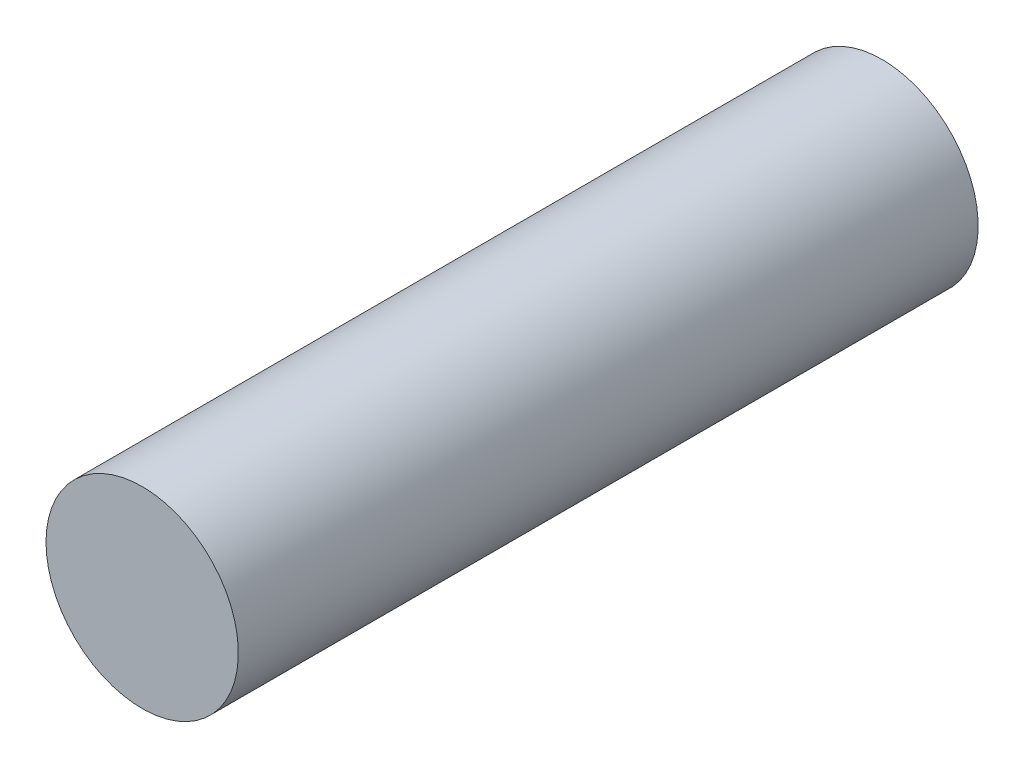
ISO-10303-21;
HEADER;
FILE_DESCRIPTION(('STEP AP214'),'2;1');
FILE_NAME('part.step','',(''),(''),'','','');
FILE_SCHEMA(('AUTOMOTIVE_DESIGN { 1 0 10303 214 1 1 1 1 }'));
ENDSEC;
DATA;
#1=APPLICATION_CONTEXT('core data for automotive mechanical design processes');
#2=APPLICATION_PROTOCOL_DEFINITION('international standard','automotive_design',2000,#1);
#3=PRODUCT_CONTEXT('',#1,'mechanical');
#4=PRODUCT('Part','Part','',(#3));
#5=PRODUCT_RELATED_PRODUCT_CATEGORY('part','',(#4));
#6=PRODUCT_DEFINITION_FORMATION('','',#4);
#7=PRODUCT_DEFINITION_CONTEXT('part definition',#1,'design');
#8=PRODUCT_DEFINITION('design','',#6,#7);
#9=PRODUCT_DEFINITION_SHAPE('','',#8);
#10=(LENGTH_UNIT() NAMED_UNIT(*) SI_UNIT(.MILLI.,.METRE.));
#11=(NAMED_UNIT(*) PLANE_ANGLE_UNIT() SI_UNIT($,.RADIAN.));
#12=(NAMED_UNIT(*) SI_UNIT($,.STERADIAN.) SOLID_ANGLE_UNIT());
#13=UNCERTAINTY_MEASURE_WITH_UNIT(LENGTH_MEASURE(1.E-05),#10,'distance_accuracy_value','');
#14=(GEOMETRIC_REPRESENTATION_CONTEXT(3) GLOBAL_UNCERTAINTY_ASSIGNED_CONTEXT((#13)) GLOBAL_UNIT_ASSIGNED_CONTEXT((#10,
#11,#12)) REPRESENTATION_CONTEXT('',''));
#15=CARTESIAN_POINT('',(0.,0.,0.));
#16=DIRECTION('',(0.,0.,1.));
#17=DIRECTION('',(1.,0.,0.));
#18=AXIS2_PLACEMENT_3D('',#15,#16,#17);
#19=CARTESIAN_POINT('',(0.,0.,15.24));
#20=DIRECTION('',(0.,0.,-1.));
#21=DIRECTION('',(-1.,0.,0.));
#22=AXIS2_PLACEMENT_3D('',#19,#20,#21);
#23=CYLINDRICAL_SURFACE('',#22,1.9812);
#24=CARTESIAN_POINT('',(0.,0.,15.24));
#25=DIRECTION('',(0.,0.,1.));
#26=DIRECTION('',(1.,0.,0.));
#27=AXIS2_PLACEMENT_3D('',#24,#25,#26);
#28=CIRCLE('',#27,1.9812);
#29=CARTESIAN_POINT('',(-1.9812,0.,15.24));
#30=VERTEX_POINT('',#29);
#31=EDGE_CURVE('E10',#30,#30,#28,.T.);
#32=CARTESIAN_POINT('',(0.,0.,0.));
#33=DIRECTION('',(0.,0.,1.));
#34=DIRECTION('',(1.,0.,0.));
#35=AXIS2_PLACEMENT_3D('',#32,#33,#34);
#36=CIRCLE('',#35,1.9812);
#37=CARTESIAN_POINT('',(-1.9812,0.,0.));
#38=VERTEX_POINT('',#37);
#39=EDGE_CURVE('E39',#38,#38,#36,.T.);
#40=CARTESIAN_POINT('',(-1.9812,0.,15.24));
#41=CARTESIAN_POINT('',(-1.9812,0.,15.08125));
#42=CARTESIAN_POINT('',(-1.9812,0.,14.9225));
#43=CARTESIAN_POINT('',(-1.9812,0.,14.605));
#44=CARTESIAN_POINT('',(-1.9812,0.,14.44625));
#45=CARTESIAN_POINT('',(-1.9812,0.,14.12875));
#46=CARTESIAN_POINT('',(-1.9812,0.,13.97));
#47=CARTESIAN_POINT('',(-1.9812,0.,13.6525));
#48=CARTESIAN_POINT('',(-1.9812,0.,13.49375));
#49=CARTESIAN_POINT('',(-1.9812,0.,13.17625));
#50=CARTESIAN_POINT('',(-1.9812,0.,13.0175));
#51=CARTESIAN_POINT('',(-1.9812,0.,12.7));
#52=CARTESIAN_POINT('',(-1.9812,0.,12.54125));
#53=CARTESIAN_POINT('',(-1.9812,0.,12.22375));
#54=CARTESIAN_POINT('',(-1.9812,0.,12.065));
#55=CARTESIAN_POINT('',(-1.9812,0.,11.7475));
#56=CARTESIAN_POINT('',(-1.9812,0.,11.58875));
#57=CARTESIAN_POINT('',(-1.9812,0.,11.27125));
#58=CARTESIAN_POINT('',(-1.9812,0.,11.1125));
#59=CARTESIAN_POINT('',(-1.9812,0.,10.795));
#60=CARTESIAN_POINT('',(-1.9812,0.,10.63625));
#61=CARTESIAN_POINT('',(-1.9812,0.,10.31875));
#62=CARTESIAN_POINT('',(-1.9812,0.,10.16));
#63=CARTESIAN_POINT('',(-1.9812,0.,9.8425));
#64=CARTESIAN_POINT('',(-1.9812,0.,9.68375));
#65=CARTESIAN_POINT('',(-1.9812,0.,9.36625));
#66=CARTESIAN_POINT('',(-1.9812,0.,9.2075));
#67=CARTESIAN_POINT('',(-1.9812,0.,8.89));
#68=CARTESIAN_POINT('',(-1.9812,0.,8.73125));
#69=CARTESIAN_POINT('',(-1.9812,0.,8.41375));
#70=CARTESIAN_POINT('',(-1.9812,0.,8.255));
#71=CARTESIAN_POINT('',(-1.9812,0.,7.9375));
#72=CARTESIAN_POINT('',(-1.9812,0.,7.77875));
#73=CARTESIAN_POINT('',(-1.9812,0.,7.46125));
#74=CARTESIAN_POINT('',(-1.9812,0.,7.3025));
#75=CARTESIAN_POINT('',(-1.9812,0.,6.985));
#76=CARTESIAN_POINT('',(-1.9812,0.,6.82625));
#77=CARTESIAN_POINT('',(-1.9812,0.,6.50875));
#78=CARTESIAN_POINT('',(-1.9812,0.,6.35));
#79=CARTESIAN_POINT('',(-1.9812,0.,6.0325));
#80=CARTESIAN_POINT('',(-1.9812,0.,5.87375));
#81=CARTESIAN_POINT('',(-1.9812,0.,5.55625));
#82=CARTESIAN_POINT('',(-1.9812,0.,5.3975));
#83=CARTESIAN_POINT('',(-1.9812,0.,5.08));
#84=CARTESIAN_POINT('',(-1.9812,0.,4.92125));
#85=CARTESIAN_POINT('',(-1.9812,0.,4.60375));
#86=CARTESIAN_POINT('',(-1.9812,0.,4.445));
#87=CARTESIAN_POINT('',(-1.9812,0.,4.1275));
#88=CARTESIAN_POINT('',(-1.9812,0.,3.96875));
#89=CARTESIAN_POINT('',(-1.9812,0.,3.65125));
#90=CARTESIAN_POINT('',(-1.9812,0.,3.4925));
#91=CARTESIAN_POINT('',(-1.9812,0.,3.175));
#92=CARTESIAN_POINT('',(-1.9812,0.,3.01625));
#93=CARTESIAN_POINT('',(-1.9812,0.,2.69875));
#94=CARTESIAN_POINT('',(-1.9812,0.,2.54));
#95=CARTESIAN_POINT('',(-1.9812,0.,2.2225));
#96=CARTESIAN_POINT('',(-1.9812,0.,2.06375));
#97=CARTESIAN_POINT('',(-1.9812,0.,1.74625));
#98=CARTESIAN_POINT('',(-1.9812,0.,1.5875));
#99=CARTESIAN_POINT('',(-1.9812,0.,1.27));
#100=CARTESIAN_POINT('',(-1.9812,0.,1.11125));
#101=CARTESIAN_POINT('',(-1.9812,0.,0.79375));
#102=CARTESIAN_POINT('',(-1.9812,0.,0.634999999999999));
#103=CARTESIAN_POINT('',(-1.9812,0.,0.3175));
#104=CARTESIAN_POINT('',(-1.9812,0.,0.15875));
#105=CARTESIAN_POINT('',(-1.9812,0.,0.));
#106=B_SPLINE_CURVE_WITH_KNOTS('',3,(#40,#41,#42,#43,#44,#45,#46,#47,#48,#49,#50,#51,#52,#53,
#54,#55,#56,#57,#58,#59,#60,#61,#62,#63,#64,#65,#66,#67,#68,#69,#70,#71,#72,#73,#74,#75,#76,#77,
#78,#79,#80,#81,#82,#83,#84,#85,#86,#87,#88,#89,#90,#91,#92,#93,#94,#95,#96,#97,#98,#99,#100,
#101,#102,#103,#104,#105),.UNSPECIFIED.,.F.,.F.,(4,2,2,2,2,2,2,2,2,2,2,2,2,2,2,2,2,2,2,2,2,2,2,
2,2,2,2,2,2,2,2,2,4),(0.,0.476249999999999,0.952499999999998,1.42875,1.905,2.38125,2.8575,
3.33375,3.81,4.28625,4.7625,5.23875,5.715,6.19125,6.6675,7.14375,7.62,8.09625,8.5725,9.04875,
9.525,10.00125,10.4775,10.95375,11.43,11.90625,12.3825,12.85875,13.335,13.81125,14.2875,
14.76375,15.24),.UNSPECIFIED.);
#107=EDGE_CURVE('BSEAM33',#30,#38,#106,.T.);
#108=ORIENTED_EDGE('',*,*,#31,.F.);
#109=ORIENTED_EDGE('',*,*,#39,.T.);
#110=ORIENTED_EDGE('',*,*,#107,.T.);
#111=ORIENTED_EDGE('',*,*,#107,.F.);
#112=EDGE_LOOP('',(#108,#110,#109,#111));
#113=FACE_BOUND('',#112,.T.);
#114=ADVANCED_FACE('F33',(#113),#23,.T.);
#115=CARTESIAN_POINT('',(0.,0.,15.24));
#116=DIRECTION('',(0.,0.,1.));
#117=DIRECTION('',(1.,0.,0.));
#118=AXIS2_PLACEMENT_3D('',#115,#116,#117);
#119=PLANE('',#118);
#120=ORIENTED_EDGE('',*,*,#31,.T.);
#121=EDGE_LOOP('',(#120));
#122=FACE_BOUND('',#121,.T.);
#123=ADVANCED_FACE('F48',(#122),#119,.T.);
#124=CARTESIAN_POINT('',(0.,0.,0.));
#125=DIRECTION('',(0.,0.,1.));
#126=DIRECTION('',(1.,0.,0.));
#127=AXIS2_PLACEMENT_3D('',#124,#125,#126);
#128=PLANE('',#127);
#129=ORIENTED_EDGE('',*,*,#39,.F.);
#130=EDGE_LOOP('',(#129));
#131=FACE_BOUND('',#130,.T.);
#132=ADVANCED_FACE('F46',(#131),#128,.F.);
#133=CLOSED_SHELL('',(#114,#123,#132));
#134=MANIFOLD_SOLID_BREP('B2',#133);
#135=ADVANCED_BREP_SHAPE_REPRESENTATION('',(#18,#134),#14);
#136=SHAPE_DEFINITION_REPRESENTATION(#9,#135);
ENDSEC;
END-ISO-10303-21;
